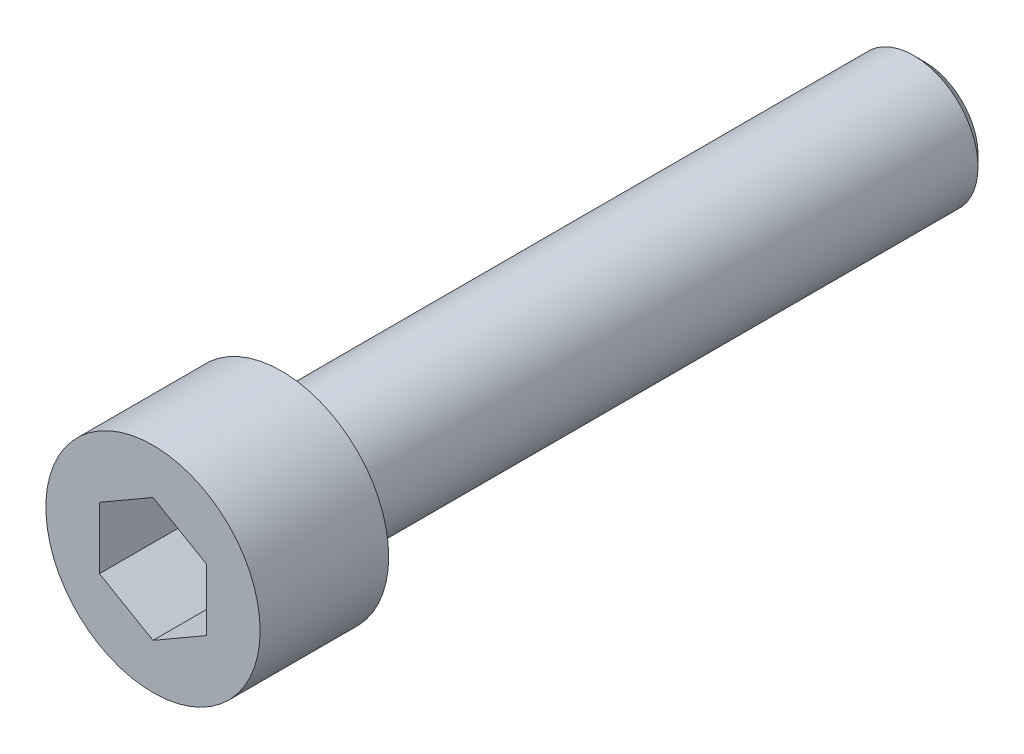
ISO-10303-21;
HEADER;
FILE_DESCRIPTION(('STEP AP214'),'2;1');
FILE_NAME('part.step','',(''),(''),'','','');
FILE_SCHEMA(('AUTOMOTIVE_DESIGN { 1 0 10303 214 1 1 1 1 }'));
ENDSEC;
DATA;
#1=APPLICATION_CONTEXT('core data for automotive mechanical design processes');
#2=APPLICATION_PROTOCOL_DEFINITION('international standard','automotive_design',2000,#1);
#3=PRODUCT_CONTEXT('',#1,'mechanical');
#4=PRODUCT('Part','Part','',(#3));
#5=PRODUCT_RELATED_PRODUCT_CATEGORY('part','',(#4));
#6=PRODUCT_DEFINITION_FORMATION('','',#4);
#7=PRODUCT_DEFINITION_CONTEXT('part definition',#1,'design');
#8=PRODUCT_DEFINITION('design','',#6,#7);
#9=PRODUCT_DEFINITION_SHAPE('','',#8);
#10=(LENGTH_UNIT() NAMED_UNIT(*) SI_UNIT(.MILLI.,.METRE.));
#11=(NAMED_UNIT(*) PLANE_ANGLE_UNIT() SI_UNIT($,.RADIAN.));
#12=(NAMED_UNIT(*) SI_UNIT($,.STERADIAN.) SOLID_ANGLE_UNIT());
#13=UNCERTAINTY_MEASURE_WITH_UNIT(LENGTH_MEASURE(1.E-05),#10,'distance_accuracy_value','');
#14=(GEOMETRIC_REPRESENTATION_CONTEXT(3) GLOBAL_UNCERTAINTY_ASSIGNED_CONTEXT((#13)) GLOBAL_UNIT_ASSIGNED_CONTEXT((#10,
#11,#12)) REPRESENTATION_CONTEXT('',''));
#15=CARTESIAN_POINT('',(0.,0.,0.));
#16=DIRECTION('',(0.,0.,1.));
#17=DIRECTION('',(1.,0.,0.));
#18=AXIS2_PLACEMENT_3D('',#15,#16,#17);
#19=CARTESIAN_POINT('',(0.,0.,-6.));
#20=DIRECTION('',(0.,0.,1.));
#21=DIRECTION('',(1.,0.,0.));
#22=AXIS2_PLACEMENT_3D('',#19,#20,#21);
#23=PLANE('',#22);
#24=CARTESIAN_POINT('',(0.,0.,-6.));
#25=DIRECTION('',(0.,0.,1.));
#26=DIRECTION('',(1.,0.,0.));
#27=AXIS2_PLACEMENT_3D('',#24,#25,#26);
#28=CIRCLE('',#27,5.);
#29=CARTESIAN_POINT('',(5.,0.,-6.));
#30=VERTEX_POINT('',#29);
#31=EDGE_CURVE('E142',#30,#30,#28,.T.);
#32=ORIENTED_EDGE('',*,*,#31,.F.);
#33=EDGE_LOOP('',(#32));
#34=FACE_BOUND('',#33,.T.);
#35=CARTESIAN_POINT('',(0.,0.,-6.));
#36=DIRECTION('',(0.,0.,1.));
#37=DIRECTION('',(1.,0.,0.));
#38=AXIS2_PLACEMENT_3D('',#35,#36,#37);
#39=CIRCLE('',#38,3.);
#40=CARTESIAN_POINT('',(3.,0.,-6.));
#41=VERTEX_POINT('',#40);
#42=EDGE_CURVE('E145',#41,#41,#39,.F.);
#43=ORIENTED_EDGE('',*,*,#42,.F.);
#44=EDGE_LOOP('',(#43));
#45=FACE_BOUND('',#44,.T.);
#46=ADVANCED_FACE('F30',(#34,#45),#23,.F.);
#47=CARTESIAN_POINT('',(0.,0.,-6.));
#48=DIRECTION('',(0.,0.,1.));
#49=DIRECTION('',(1.,0.,0.));
#50=AXIS2_PLACEMENT_3D('',#47,#48,#49);
#51=CYLINDRICAL_SURFACE('',#50,5.);
#52=ORIENTED_EDGE('',*,*,#31,.T.);
#53=EDGE_LOOP('',(#52));
#54=FACE_BOUND('',#53,.T.);
#55=CARTESIAN_POINT('',(0.,0.,0.));
#56=DIRECTION('',(0.,0.,1.));
#57=DIRECTION('',(1.,0.,0.));
#58=AXIS2_PLACEMENT_3D('',#55,#56,#57);
#59=CIRCLE('',#58,5.);
#60=CARTESIAN_POINT('',(5.,0.,0.));
#61=VERTEX_POINT('',#60);
#62=EDGE_CURVE('E133',#61,#61,#59,.T.);
#63=ORIENTED_EDGE('',*,*,#62,.F.);
#64=EDGE_LOOP('',(#63));
#65=FACE_BOUND('',#64,.T.);
#66=ADVANCED_FACE('F32',(#54,#65),#51,.T.);
#67=CARTESIAN_POINT('',(0.,0.,0.));
#68=DIRECTION('',(0.,0.,1.));
#69=DIRECTION('',(1.,0.,0.));
#70=AXIS2_PLACEMENT_3D('',#67,#68,#69);
#71=PLANE('',#70);
#72=DIRECTION('',(0.866025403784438,0.500000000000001,0.));
#73=VECTOR('',#72,1.);
#74=CARTESIAN_POINT('',(0.,-2.88675134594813,0.));
#75=LINE('',#74,#73);
#76=CARTESIAN_POINT('',(0.,-2.88675134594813,0.));
#77=VERTEX_POINT('',#76);
#78=CARTESIAN_POINT('',(2.5,-1.44337567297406,0.));
#79=VERTEX_POINT('',#78);
#80=EDGE_CURVE('E45',#77,#79,#75,.T.);
#81=ORIENTED_EDGE('',*,*,#80,.F.);
#82=DIRECTION('',(0.866025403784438,-0.5,0.));
#83=VECTOR('',#82,1.);
#84=CARTESIAN_POINT('',(-2.5,-1.44337567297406,0.));
#85=LINE('',#84,#83);
#86=CARTESIAN_POINT('',(-2.5,-1.44337567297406,0.));
#87=VERTEX_POINT('',#86);
#88=EDGE_CURVE('E115',#87,#77,#85,.T.);
#89=ORIENTED_EDGE('',*,*,#88,.F.);
#90=DIRECTION('',(0.,-1.,0.));
#91=VECTOR('',#90,1.);
#92=CARTESIAN_POINT('',(-2.5,1.44337567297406,0.));
#93=LINE('',#92,#91);
#94=CARTESIAN_POINT('',(-2.5,1.44337567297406,0.));
#95=VERTEX_POINT('',#94);
#96=EDGE_CURVE('E109',#95,#87,#93,.T.);
#97=ORIENTED_EDGE('',*,*,#96,.F.);
#98=DIRECTION('',(-0.866025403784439,-0.5,0.));
#99=VECTOR('',#98,1.);
#100=CARTESIAN_POINT('',(0.,2.88675134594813,0.));
#101=LINE('',#100,#99);
#102=CARTESIAN_POINT('',(0.,2.88675134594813,0.));
#103=VERTEX_POINT('',#102);
#104=EDGE_CURVE('E107',#103,#95,#101,.T.);
#105=ORIENTED_EDGE('',*,*,#104,.F.);
#106=DIRECTION('',(-0.866025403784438,0.5,0.));
#107=VECTOR('',#106,1.);
#108=CARTESIAN_POINT('',(2.5,1.44337567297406,0.));
#109=LINE('',#108,#107);
#110=CARTESIAN_POINT('',(2.5,1.44337567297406,0.));
#111=VERTEX_POINT('',#110);
#112=EDGE_CURVE('E88',#111,#103,#109,.T.);
#113=ORIENTED_EDGE('',*,*,#112,.F.);
#114=DIRECTION('',(0.,1.,0.));
#115=VECTOR('',#114,1.);
#116=CARTESIAN_POINT('',(2.5,-1.44337567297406,0.));
#117=LINE('',#116,#115);
#118=EDGE_CURVE('E99',#79,#111,#117,.T.);
#119=ORIENTED_EDGE('',*,*,#118,.F.);
#120=EDGE_LOOP('',(#81,#89,#97,#105,#113,#119));
#121=FACE_BOUND('',#120,.T.);
#122=ORIENTED_EDGE('',*,*,#62,.T.);
#123=EDGE_LOOP('',(#122));
#124=FACE_BOUND('',#123,.T.);
#125=ADVANCED_FACE('F103',(#121,#124),#71,.T.);
#126=CARTESIAN_POINT('',(0.,0.,-36.));
#127=DIRECTION('',(0.,0.,1.));
#128=DIRECTION('',(1.,0.,0.));
#129=AXIS2_PLACEMENT_3D('',#126,#127,#128);
#130=CYLINDRICAL_SURFACE('',#129,3.);
#131=CARTESIAN_POINT('',(0.,0.,-35.5));
#132=DIRECTION('',(0.,0.,-1.));
#133=DIRECTION('',(-1.,0.,0.));
#134=AXIS2_PLACEMENT_3D('',#131,#132,#133);
#135=CIRCLE('',#134,3.);
#136=CARTESIAN_POINT('',(-3.,0.,-35.5));
#137=VERTEX_POINT('',#136);
#138=EDGE_CURVE('E11',#137,#137,#135,.F.);
#139=ORIENTED_EDGE('',*,*,#138,.T.);
#140=EDGE_LOOP('',(#139));
#141=FACE_BOUND('',#140,.T.);
#142=ORIENTED_EDGE('',*,*,#42,.T.);
#143=EDGE_LOOP('',(#142));
#144=FACE_BOUND('',#143,.T.);
#145=ADVANCED_FACE('F174',(#141,#144),#130,.T.);
#146=CARTESIAN_POINT('',(0.,0.,-36.));
#147=DIRECTION('',(0.,0.,-1.));
#148=DIRECTION('',(-1.,0.,0.));
#149=AXIS2_PLACEMENT_3D('',#146,#147,#148);
#150=PLANE('',#149);
#151=CARTESIAN_POINT('',(0.,0.,-36.));
#152=DIRECTION('',(0.,0.,-1.));
#153=DIRECTION('',(-1.,0.,0.));
#154=AXIS2_PLACEMENT_3D('',#151,#152,#153);
#155=CIRCLE('',#154,2.5);
#156=CARTESIAN_POINT('',(-2.5,0.,-36.));
#157=VERTEX_POINT('',#156);
#158=EDGE_CURVE('E38',#157,#157,#155,.T.);
#159=ORIENTED_EDGE('',*,*,#158,.T.);
#160=EDGE_LOOP('',(#159));
#161=FACE_BOUND('',#160,.T.);
#162=ADVANCED_FACE('F150',(#161),#150,.T.);
#163=CARTESIAN_POINT('',(0.,-2.88675134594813,-5.));
#164=DIRECTION('',(0.500000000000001,-0.866025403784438,0.));
#165=DIRECTION('',(0.866025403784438,0.500000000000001,0.));
#166=AXIS2_PLACEMENT_3D('',#163,#164,#165);
#167=PLANE('',#166);
#168=ORIENTED_EDGE('',*,*,#80,.T.);
#169=DIRECTION('',(0.,0.,1.));
#170=VECTOR('',#169,1.);
#171=CARTESIAN_POINT('',(2.5,-1.44337567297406,-5.));
#172=LINE('',#171,#170);
#173=CARTESIAN_POINT('',(2.5,-1.44337567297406,-5.));
#174=VERTEX_POINT('',#173);
#175=EDGE_CURVE('E96',#174,#79,#172,.T.);
#176=ORIENTED_EDGE('',*,*,#175,.F.);
#177=DIRECTION('',(0.866025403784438,0.500000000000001,0.));
#178=VECTOR('',#177,1.);
#179=CARTESIAN_POINT('',(0.,-2.88675134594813,-5.));
#180=LINE('',#179,#178);
#181=CARTESIAN_POINT('',(0.,-2.88675134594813,-5.));
#182=VERTEX_POINT('',#181);
#183=EDGE_CURVE('E117',#182,#174,#180,.T.);
#184=ORIENTED_EDGE('',*,*,#183,.F.);
#185=DIRECTION('',(0.,0.,1.));
#186=VECTOR('',#185,1.);
#187=CARTESIAN_POINT('',(0.,-2.88675134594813,-5.));
#188=LINE('',#187,#186);
#189=EDGE_CURVE('E52',#182,#77,#188,.T.);
#190=ORIENTED_EDGE('',*,*,#189,.T.);
#191=EDGE_LOOP('',(#168,#176,#184,#190));
#192=FACE_BOUND('',#191,.T.);
#193=ADVANCED_FACE('F180',(#192),#167,.F.);
#194=CARTESIAN_POINT('',(-2.5,-1.44337567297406,-5.));
#195=DIRECTION('',(-0.5,-0.866025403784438,0.));
#196=DIRECTION('',(0.866025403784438,-0.5,0.));
#197=AXIS2_PLACEMENT_3D('',#194,#195,#196);
#198=PLANE('',#197);
#199=ORIENTED_EDGE('',*,*,#88,.T.);
#200=ORIENTED_EDGE('',*,*,#189,.F.);
#201=DIRECTION('',(0.866025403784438,-0.5,0.));
#202=VECTOR('',#201,1.);
#203=CARTESIAN_POINT('',(-2.5,-1.44337567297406,-5.));
#204=LINE('',#203,#202);
#205=CARTESIAN_POINT('',(-2.5,-1.44337567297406,-5.));
#206=VERTEX_POINT('',#205);
#207=EDGE_CURVE('E129',#206,#182,#204,.T.);
#208=ORIENTED_EDGE('',*,*,#207,.F.);
#209=DIRECTION('',(0.,0.,1.));
#210=VECTOR('',#209,1.);
#211=CARTESIAN_POINT('',(-2.5,-1.44337567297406,-5.));
#212=LINE('',#211,#210);
#213=EDGE_CURVE('E134',#206,#87,#212,.T.);
#214=ORIENTED_EDGE('',*,*,#213,.T.);
#215=EDGE_LOOP('',(#199,#200,#208,#214));
#216=FACE_BOUND('',#215,.T.);
#217=ADVANCED_FACE('F183',(#216),#198,.F.);
#218=CARTESIAN_POINT('',(-2.5,1.44337567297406,-5.));
#219=DIRECTION('',(-1.,0.,0.));
#220=DIRECTION('',(0.,-1.,0.));
#221=AXIS2_PLACEMENT_3D('',#218,#219,#220);
#222=PLANE('',#221);
#223=ORIENTED_EDGE('',*,*,#96,.T.);
#224=ORIENTED_EDGE('',*,*,#213,.F.);
#225=DIRECTION('',(0.,-1.,0.));
#226=VECTOR('',#225,1.);
#227=CARTESIAN_POINT('',(-2.5,1.44337567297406,-5.));
#228=LINE('',#227,#226);
#229=CARTESIAN_POINT('',(-2.5,1.44337567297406,-5.));
#230=VERTEX_POINT('',#229);
#231=EDGE_CURVE('E126',#230,#206,#228,.T.);
#232=ORIENTED_EDGE('',*,*,#231,.F.);
#233=DIRECTION('',(0.,0.,1.));
#234=VECTOR('',#233,1.);
#235=CARTESIAN_POINT('',(-2.5,1.44337567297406,-5.));
#236=LINE('',#235,#234);
#237=EDGE_CURVE('E136',#230,#95,#236,.T.);
#238=ORIENTED_EDGE('',*,*,#237,.T.);
#239=EDGE_LOOP('',(#223,#224,#232,#238));
#240=FACE_BOUND('',#239,.T.);
#241=ADVANCED_FACE('F191',(#240),#222,.F.);
#242=CARTESIAN_POINT('',(0.,2.88675134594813,-5.));
#243=DIRECTION('',(-0.5,0.866025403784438,0.));
#244=DIRECTION('',(-0.866025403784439,-0.5,0.));
#245=AXIS2_PLACEMENT_3D('',#242,#243,#244);
#246=PLANE('',#245);
#247=ORIENTED_EDGE('',*,*,#104,.T.);
#248=ORIENTED_EDGE('',*,*,#237,.F.);
#249=DIRECTION('',(-0.866025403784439,-0.5,0.));
#250=VECTOR('',#249,1.);
#251=CARTESIAN_POINT('',(0.,2.88675134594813,-5.));
#252=LINE('',#251,#250);
#253=CARTESIAN_POINT('',(0.,2.88675134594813,-5.));
#254=VERTEX_POINT('',#253);
#255=EDGE_CURVE('E123',#254,#230,#252,.T.);
#256=ORIENTED_EDGE('',*,*,#255,.F.);
#257=DIRECTION('',(0.,0.,1.));
#258=VECTOR('',#257,1.);
#259=CARTESIAN_POINT('',(0.,2.88675134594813,-5.));
#260=LINE('',#259,#258);
#261=EDGE_CURVE('E95',#254,#103,#260,.T.);
#262=ORIENTED_EDGE('',*,*,#261,.T.);
#263=EDGE_LOOP('',(#247,#248,#256,#262));
#264=FACE_BOUND('',#263,.T.);
#265=ADVANCED_FACE('F188',(#264),#246,.F.);
#266=CARTESIAN_POINT('',(2.5,1.44337567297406,-5.));
#267=DIRECTION('',(0.5,0.866025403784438,0.));
#268=DIRECTION('',(-0.866025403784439,0.5,0.));
#269=AXIS2_PLACEMENT_3D('',#266,#267,#268);
#270=PLANE('',#269);
#271=ORIENTED_EDGE('',*,*,#112,.T.);
#272=ORIENTED_EDGE('',*,*,#261,.F.);
#273=DIRECTION('',(-0.866025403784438,0.5,0.));
#274=VECTOR('',#273,1.);
#275=CARTESIAN_POINT('',(2.5,1.44337567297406,-5.));
#276=LINE('',#275,#274);
#277=CARTESIAN_POINT('',(2.5,1.44337567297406,-5.));
#278=VERTEX_POINT('',#277);
#279=EDGE_CURVE('E91',#278,#254,#276,.T.);
#280=ORIENTED_EDGE('',*,*,#279,.F.);
#281=DIRECTION('',(0.,0.,1.));
#282=VECTOR('',#281,1.);
#283=CARTESIAN_POINT('',(2.5,1.44337567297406,-5.));
#284=LINE('',#283,#282);
#285=EDGE_CURVE('E84',#278,#111,#284,.T.);
#286=ORIENTED_EDGE('',*,*,#285,.T.);
#287=EDGE_LOOP('',(#271,#272,#280,#286));
#288=FACE_BOUND('',#287,.T.);
#289=ADVANCED_FACE('F86',(#288),#270,.F.);
#290=CARTESIAN_POINT('',(2.5,-1.44337567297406,-5.));
#291=DIRECTION('',(1.,0.,0.));
#292=DIRECTION('',(0.,0.,-1.));
#293=AXIS2_PLACEMENT_3D('',#290,#291,#292);
#294=PLANE('',#293);
#295=ORIENTED_EDGE('',*,*,#118,.T.);
#296=ORIENTED_EDGE('',*,*,#285,.F.);
#297=DIRECTION('',(0.,1.,0.));
#298=VECTOR('',#297,1.);
#299=CARTESIAN_POINT('',(2.5,-1.44337567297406,-5.));
#300=LINE('',#299,#298);
#301=EDGE_CURVE('E120',#174,#278,#300,.T.);
#302=ORIENTED_EDGE('',*,*,#301,.F.);
#303=ORIENTED_EDGE('',*,*,#175,.T.);
#304=EDGE_LOOP('',(#295,#296,#302,#303));
#305=FACE_BOUND('',#304,.T.);
#306=ADVANCED_FACE('F100',(#305),#294,.F.);
#307=CARTESIAN_POINT('',(0.,-2.88675134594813,-5.));
#308=DIRECTION('',(0.,0.,-1.));
#309=DIRECTION('',(-1.,0.,0.));
#310=AXIS2_PLACEMENT_3D('',#307,#308,#309);
#311=PLANE('',#310);
#312=ORIENTED_EDGE('',*,*,#183,.T.);
#313=ORIENTED_EDGE('',*,*,#301,.T.);
#314=ORIENTED_EDGE('',*,*,#279,.T.);
#315=ORIENTED_EDGE('',*,*,#255,.T.);
#316=ORIENTED_EDGE('',*,*,#231,.T.);
#317=ORIENTED_EDGE('',*,*,#207,.T.);
#318=EDGE_LOOP('',(#312,#313,#314,#315,#316,#317));
#319=FACE_BOUND('',#318,.T.);
#320=ADVANCED_FACE('F154',(#319),#311,.F.);
#321=CARTESIAN_POINT('',(0.,0.,-36.));
#322=DIRECTION('',(0.,0.,1.));
#323=DIRECTION('',(1.,0.,0.));
#324=AXIS2_PLACEMENT_3D('',#321,#322,#323);
#325=CONICAL_SURFACE('',#324,2.5,0.785398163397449);
#326=ORIENTED_EDGE('',*,*,#138,.F.);
#327=EDGE_LOOP('',(#326));
#328=FACE_BOUND('',#327,.T.);
#329=ORIENTED_EDGE('',*,*,#158,.F.);
#330=EDGE_LOOP('',(#329));
#331=FACE_BOUND('',#330,.T.);
#332=ADVANCED_FACE('F152',(#328,#331),#325,.T.);
#333=CLOSED_SHELL('',(#46,#66,#125,#145,#162,#193,#217,#241,#265,#289,#306,#320,#332));
#334=MANIFOLD_SOLID_BREP('B2',#333);
#335=ADVANCED_BREP_SHAPE_REPRESENTATION('',(#18,#334),#14);
#336=SHAPE_DEFINITION_REPRESENTATION(#9,#335);
ENDSEC;
END-ISO-10303-21;
